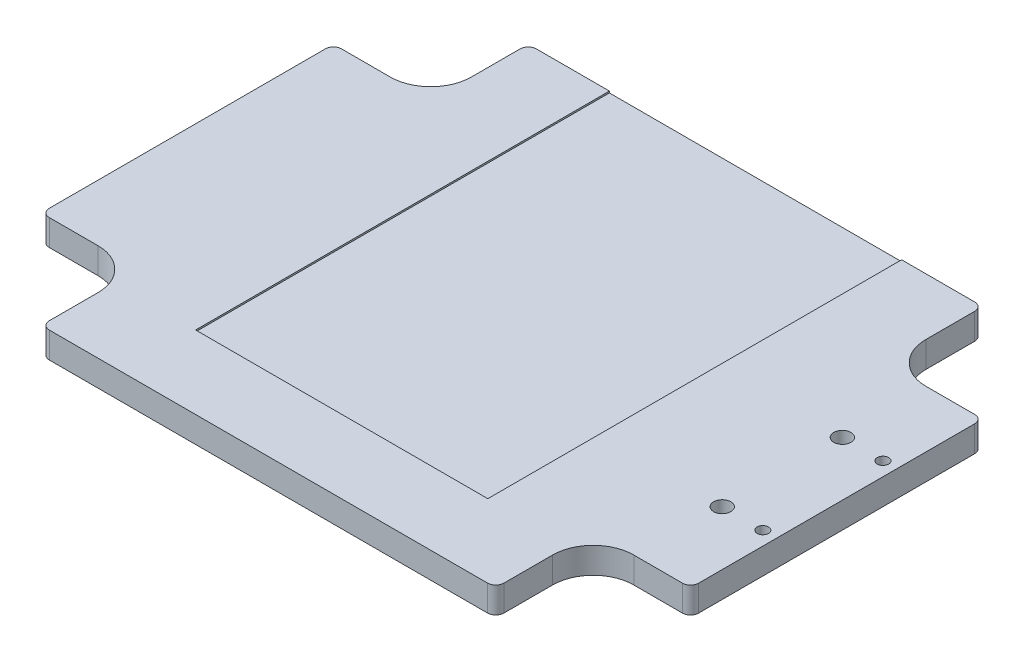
from build123d import *

# Parameters (mm, degrees)
SKETCH1_R           = 0.53
SKETCH1_R_2         = 0.35
BOSS_EXTRUDE1_DEPTH = 1.6
SKETCH2_W           = 18
SKETCH2_H           = 25.49
CUT_EXTRUDE1_DEPTH  = 0.1
SKETCH3_W           = 4.6
SKETCH3_H           = 1
SKETCH3_W_2         = 3.4
SKETCH3_H_2         = 1.6
SKETCH3_W_3         = 0.6
SKETCH3_H_3         = 1.35
SKETCH3_W_4         = 1.2
SKETCH3_H_4         = 2
CUT_EXTRUDE2_DEPTH  = 0.1


with BuildPart() as part:
    # Sketch1 → Boss-Extrude1 (new body)
    with BuildSketch(Plane(origin=(0, 0, 0), x_dir=(1, 0, 0), z_dir=(0, 1, 0))):
        with BuildLine():
            Line((-19.5, 9), (-16.5, 9))
            ThreePointArc((-16.5, 9), (-14.732233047, 9.732233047), (-14, 11.5))
            Line((-14, 11.5), (-14, 14.5))
            ThreePointArc((-14, 14.5), (-13.853553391, 14.853553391), (-13.5, 15))
            Line((-13.5, 15), (13.5, 15))
            ThreePointArc((13.5, 15), (13.853553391, 14.853553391), (14, 14.5))
            Line((14, 14.5), (14, 11.5))
            ThreePointArc((14, 11.5), (14.732233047, 9.732233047), (16.5, 9))
            Line((16.5, 9), (19.5, 9))
            ThreePointArc((19.5, 9), (19.853553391, 8.853553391), (20, 8.5))
            Line((20, 8.5), (20, -8.5))
            ThreePointArc((20, -8.5), (19.853553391, -8.853553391), (19.5, -9))
            Line((19.5, -9), (16.5, -9))
            ThreePointArc((16.5, -9), (14.732233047, -9.732233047), (14, -11.5))
            Line((14, -11.5), (14, -14.5))
            ThreePointArc((14, -14.5), (13.853553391, -14.853553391), (13.5, -15))
            Line((13.5, -15), (-13.5, -15))
            ThreePointArc((-13.5, -15), (-13.853553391, -14.853553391), (-14, -14.5))
            Line((-14, -14.5), (-14, -11.5))
            ThreePointArc((-14, -11.5), (-14.732233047, -9.732233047), (-16.5, -9))
            Line((-16.5, -9), (-19.5, -9))
            ThreePointArc((-19.5, -9), (-19.853553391, -8.853553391), (-20, -8.5))
            Line((-20, -8.5), (-20, 8.5))
            ThreePointArc((-20, 8.5), (-19.853553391, 8.853553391), (-19.5, 9))
        make_face()
        with Locations(Location((16.65, 3.7, 0), (0, 0, 270))):
            Circle(SKETCH1_R, mode=Mode.SUBTRACT)
        with Locations(Location((16.65, -3.7, 0), (0, 0, 270))):
            Circle(SKETCH1_R, mode=Mode.SUBTRACT)
        with Locations(Location((19.15, -3.7, 0), (0, 0, 270))):
            Circle(SKETCH1_R_2, mode=Mode.SUBTRACT)
        with Locations(Location((19.15, 3.7, 0), (0, 0, 270))):
            Circle(SKETCH1_R_2, mode=Mode.SUBTRACT)
    extrude(amount=BOSS_EXTRUDE1_DEPTH)

    # Sketch2 → Cut-Extrude1 (cut)
    with BuildSketch(Plane(origin=(0, 1.6, 0), x_dir=(1, 0, 0), z_dir=(0, 1, 0))):
        with Locations((0, 2.255)):
            Rectangle(SKETCH2_W, SKETCH2_H)
    extrude(amount=-CUT_EXTRUDE1_DEPTH, mode=Mode.SUBTRACT)

    # Sketch3 → Cut-Extrude2 (cut)
    with BuildSketch(Plane.XZ):
        with Locations((-17.2, -5.5)):
            Rectangle(SKETCH3_W, SKETCH3_H)
        with Locations((-17.2, -3.5)):
            Rectangle(SKETCH3_W, SKETCH3_H)
        with Locations((-12, -7.9)):
            Rectangle(SKETCH3_W_2, SKETCH3_H_2)
        with Locations((-12, -1.1)):
            Rectangle(SKETCH3_W_2, SKETCH3_H_2)
        with Locations((-17.2, 3.5)):
            Rectangle(SKETCH3_W, SKETCH3_H)
        with Locations((-17.2, 5.5)):
            Rectangle(SKETCH3_W, SKETCH3_H)
        with Locations((-12, 1.1)):
            Rectangle(SKETCH3_W_2, SKETCH3_H_2)
        with Locations((-12, 7.9)):
            Rectangle(SKETCH3_W_2, SKETCH3_H_2)
        with Locations((-9.6, 9.925)):
            Rectangle(SKETCH3_W_3, SKETCH3_H_3)
        with Locations((-8.6, 9.925)):
            Rectangle(SKETCH3_W_3, SKETCH3_H_3)
        with Locations((-7.3, 13.6)):
            Rectangle(SKETCH3_W_4, SKETCH3_H_4)
        with Locations((-10.6, 9.925)):
            Rectangle(SKETCH3_W_3, SKETCH3_H_3)
        with Locations((-11.6, 9.925)):
            Rectangle(SKETCH3_W_3, SKETCH3_H_3)
        with Locations((-12.9, 13.6)):
            Rectangle(SKETCH3_W_4, SKETCH3_H_4)
    extrude(amount=-CUT_EXTRUDE2_DEPTH, mode=Mode.SUBTRACT)


solid = part.part
